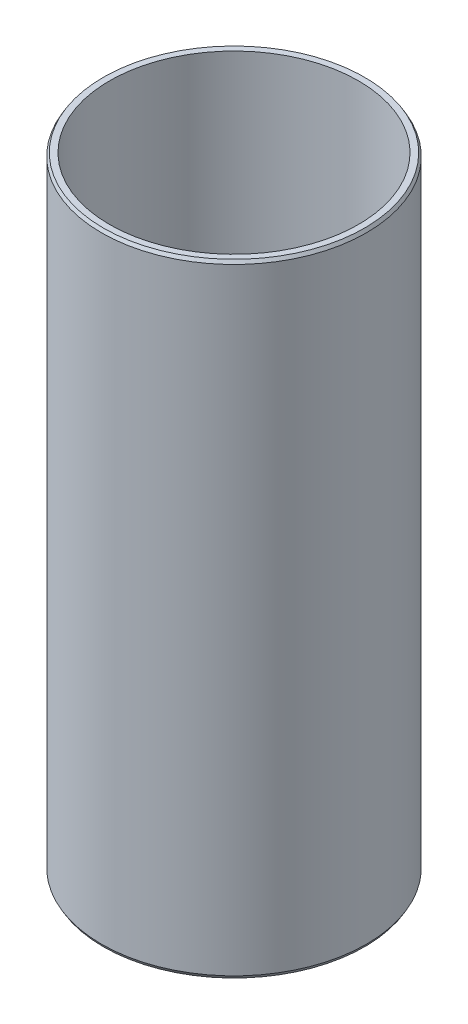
from build123d import *

# Parameters (mm, degrees)
ESQUISSE1_R      = 41.5
ESQUISSE1_R_2    = 39
EXTRUSION1_DEPTH = 195
CHANFREIN1_SIZE  = 1
CHANFREIN1_SIZE2 = 0.577350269


with BuildPart() as part:
    # Esquisse1 → Extrusion1 (new body)
    with BuildSketch(Plane(origin=(0, 0, 0), x_dir=(1, 0, 0), z_dir=(0, 1, 0))):
        with Locations(Location((0, 0, 0), (0, 0, 270))):
            Circle(ESQUISSE1_R)
        with Locations(Location((0, 0, 0), (0, 0, 270))):
            Circle(ESQUISSE1_R_2, mode=Mode.SUBTRACT)
    extrude(amount=EXTRUSION1_DEPTH)

    # Chanfrein1
    chanfrein1_edges = [part.edges().sort_by_distance(p)[0] for p in [
        (0, 0, -41.5),
        (0, 195, -41.5),
    ]]
    chanfrein1_side = [part.faces().sort_by_distance(p)[0] for p in [
        (0, 97.5, -41.5),
    ]]
    chamfer(chanfrein1_edges, length=CHANFREIN1_SIZE, length2=CHANFREIN1_SIZE2, reference=chanfrein1_side[0])


solid = part.part
